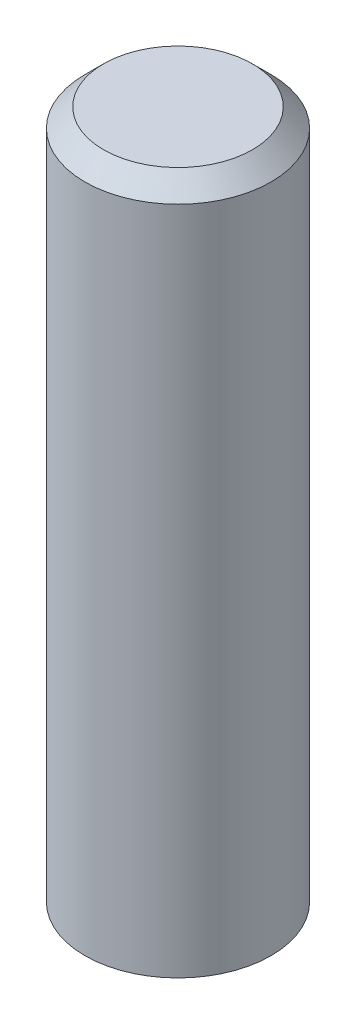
from build123d import *


with BuildPart() as part:
    # Esquisse1 → R_volution1 (revolve)
    with BuildSketch(Plane(origin=(0, 0, 0), x_dir=(-1, 0, 0), z_dir=(0, 0, -1)), mode=Mode.PRIVATE) as r_volution1_sk:
        Polygon((-5, 0), (0, 0), (0, 37), (-4, 37), (-5, 36), align=None)
    revolve(r_volution1_sk.sketch.rotate(Axis((0, 0, 0), (0, 1, 0)), 270), axis=Axis((0, 0, 0), (0, 1, 0)))


solid = part.part
